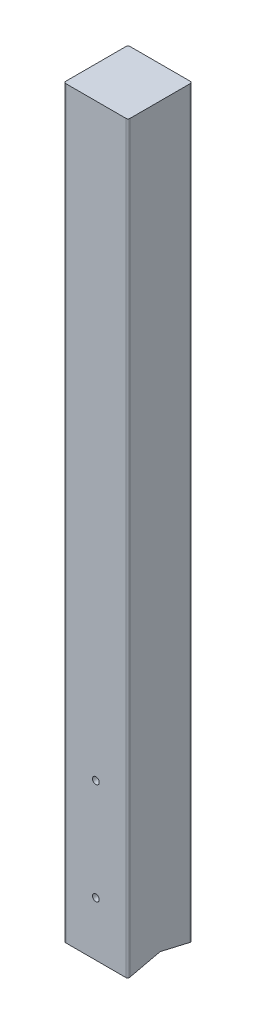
ISO-10303-21;
HEADER;
FILE_DESCRIPTION(('STEP AP214'),'2;1');
FILE_NAME('part.step','',(''),(''),'','','');
FILE_SCHEMA(('AUTOMOTIVE_DESIGN { 1 0 10303 214 1 1 1 1 }'));
ENDSEC;
DATA;
#1=APPLICATION_CONTEXT('core data for automotive mechanical design processes');
#2=APPLICATION_PROTOCOL_DEFINITION('international standard','automotive_design',2000,#1);
#3=PRODUCT_CONTEXT('',#1,'mechanical');
#4=PRODUCT('Part','Part','',(#3));
#5=PRODUCT_RELATED_PRODUCT_CATEGORY('part','',(#4));
#6=PRODUCT_DEFINITION_FORMATION('','',#4);
#7=PRODUCT_DEFINITION_CONTEXT('part definition',#1,'design');
#8=PRODUCT_DEFINITION('design','',#6,#7);
#9=PRODUCT_DEFINITION_SHAPE('','',#8);
#10=(LENGTH_UNIT() NAMED_UNIT(*) SI_UNIT(.MILLI.,.METRE.));
#11=(NAMED_UNIT(*) PLANE_ANGLE_UNIT() SI_UNIT($,.RADIAN.));
#12=(NAMED_UNIT(*) SI_UNIT($,.STERADIAN.) SOLID_ANGLE_UNIT());
#13=UNCERTAINTY_MEASURE_WITH_UNIT(LENGTH_MEASURE(1.E-05),#10,'distance_accuracy_value','');
#14=(GEOMETRIC_REPRESENTATION_CONTEXT(3) GLOBAL_UNCERTAINTY_ASSIGNED_CONTEXT((#13)) GLOBAL_UNIT_ASSIGNED_CONTEXT((#10,
#11,#12)) REPRESENTATION_CONTEXT('',''));
#15=CARTESIAN_POINT('',(0.,0.,0.));
#16=DIRECTION('',(0.,0.,1.));
#17=DIRECTION('',(1.,0.,0.));
#18=AXIS2_PLACEMENT_3D('',#15,#16,#17);
#19=CARTESIAN_POINT('',(0.,80.,47.501));
#20=DIRECTION('',(0.,0.,-1.));
#21=DIRECTION('',(-1.,0.,0.));
#22=AXIS2_PLACEMENT_3D('',#19,#20,#21);
#23=CYLINDRICAL_SURFACE('',#22,5.);
#24=CARTESIAN_POINT('',(0.,80.,47.5));
#25=DIRECTION('',(0.,0.,-1.));
#26=DIRECTION('',(-1.,0.,0.));
#27=AXIS2_PLACEMENT_3D('',#24,#25,#26);
#28=CIRCLE('',#27,5.);
#29=CARTESIAN_POINT('',(-5.,80.,47.5));
#30=VERTEX_POINT('',#29);
#31=EDGE_CURVE('E153',#30,#30,#28,.T.);
#32=ORIENTED_EDGE('',*,*,#31,.F.);
#33=EDGE_LOOP('',(#32));
#34=FACE_BOUND('',#33,.T.);
#35=CARTESIAN_POINT('',(-5.,80.,32.1130814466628));
#36=CARTESIAN_POINT('',(-5.00000195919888,80.1395798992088,32.1130806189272));
#37=CARTESIAN_POINT('',(-4.99415332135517,80.2791325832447,32.1139932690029));
#38=CARTESIAN_POINT('',(-4.9708059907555,80.5572799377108,32.1176156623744));
#39=CARTESIAN_POINT('',(-4.95330487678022,80.6958744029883,32.1203257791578));
#40=CARTESIAN_POINT('',(-4.90676610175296,80.9711589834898,32.1274679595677));
#41=CARTESIAN_POINT('',(-4.87772070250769,81.107847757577,32.131901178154));
#42=CARTESIAN_POINT('',(-4.80830138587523,81.3783091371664,32.1423625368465));
#43=CARTESIAN_POINT('',(-4.76792331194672,81.5120806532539,32.1483912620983));
#44=CARTESIAN_POINT('',(-4.67619783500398,81.7755591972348,32.1618612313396));
#45=CARTESIAN_POINT('',(-4.62486322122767,81.9052707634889,32.1693008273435));
#46=CARTESIAN_POINT('',(-4.51155169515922,82.1599380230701,32.1853875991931));
#47=CARTESIAN_POINT('',(-4.44957086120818,82.2848919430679,32.1940352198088));
#48=CARTESIAN_POINT('',(-4.31545967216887,82.5290710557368,32.2122862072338));
#49=CARTESIAN_POINT('',(-4.24333453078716,82.6482991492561,32.2218890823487));
#50=CARTESIAN_POINT('',(-4.08939050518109,82.8803257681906,32.2417882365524));
#51=CARTESIAN_POINT('',(-4.00756802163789,82.993121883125,32.2520847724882));
#52=CARTESIAN_POINT('',(-3.83419895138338,83.2122541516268,32.2731559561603));
#53=CARTESIAN_POINT('',(-3.7425869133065,83.3185382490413,32.2839335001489));
#54=CARTESIAN_POINT('',(-3.55072830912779,83.5230663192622,32.3055977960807));
#55=CARTESIAN_POINT('',(-3.45047855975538,83.6213073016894,32.3164845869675));
#56=CARTESIAN_POINT('',(-3.24209755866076,83.8089971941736,32.3380545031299));
#57=CARTESIAN_POINT('',(-3.13396876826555,83.8984488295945,32.3487376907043));
#58=CARTESIAN_POINT('',(-2.9105049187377,84.0680019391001,32.3696085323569));
#59=CARTESIAN_POINT('',(-2.79516721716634,84.148099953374,32.3797960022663));
#60=CARTESIAN_POINT('',(-2.55755727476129,84.2986947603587,32.3994316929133));
#61=CARTESIAN_POINT('',(-2.43525494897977,84.3691445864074,32.4088762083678));
#62=CARTESIAN_POINT('',(-2.18502800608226,84.4995072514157,32.4267080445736));
#63=CARTESIAN_POINT('',(-2.05710131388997,84.5594161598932,32.4350949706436));
#64=CARTESIAN_POINT('',(-1.79661354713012,84.6681990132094,32.450565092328));
#65=CARTESIAN_POINT('',(-1.66405441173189,84.717077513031,32.4576488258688));
#66=CARTESIAN_POINT('',(-1.39520121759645,84.8034768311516,32.4703186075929));
#67=CARTESIAN_POINT('',(-1.25890581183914,84.8409934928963,32.4759041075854));
#68=CARTESIAN_POINT('',(-0.848150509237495,84.93547893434,32.4900735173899));
#69=CARTESIAN_POINT('',(-0.569453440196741,84.9753683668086,32.4962151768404));
#70=CARTESIAN_POINT('',(-0.00941136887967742,85.0078633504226,32.501207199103));
#71=CARTESIAN_POINT('',(0.271933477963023,85.0004716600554,32.5000579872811));
#72=CARTESIAN_POINT('',(0.826964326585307,84.9389664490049,32.4906523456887));
#73=CARTESIAN_POINT('',(1.10069493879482,84.8852479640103,32.482456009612));
#74=CARTESIAN_POINT('',(1.63519916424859,84.7332177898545,32.4599406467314));
#75=CARTESIAN_POINT('',(1.8959724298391,84.6349049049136,32.4456214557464));
#76=CARTESIAN_POINT('',(2.39836413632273,84.3960792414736,32.4123670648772));
#77=CARTESIAN_POINT('',(2.63990263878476,84.25540090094,32.3934138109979));
#78=CARTESIAN_POINT('',(3.09609321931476,83.9359574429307,32.3530019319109));
#79=CARTESIAN_POINT('',(3.31074343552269,83.7571896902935,32.3315431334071));
#80=CARTESIAN_POINT('',(3.70939574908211,83.364443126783,32.2882499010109));
#81=CARTESIAN_POINT('',(3.89305786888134,83.1501192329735,32.2664138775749));
#82=CARTESIAN_POINT('',(4.22186329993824,82.6935144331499,32.2250433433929));
#83=CARTESIAN_POINT('',(4.36700635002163,82.4512333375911,32.2055088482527));
#84=CARTESIAN_POINT('',(4.61470418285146,81.9452284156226,32.170953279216));
#85=CARTESIAN_POINT('',(4.71722269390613,81.6814865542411,32.1559360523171));
#86=CARTESIAN_POINT('',(4.87641223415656,81.1402449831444,32.1321823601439));
#87=CARTESIAN_POINT('',(4.93308667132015,80.8627462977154,32.1234454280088));
#88=CARTESIAN_POINT('',(4.99851026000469,80.3048968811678,32.11333050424));
#89=CARTESIAN_POINT('',(5.00774195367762,80.0246040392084,32.1118784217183));
#90=CARTESIAN_POINT('',(4.97929961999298,79.4664749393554,32.1163007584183));
#91=CARTESIAN_POINT('',(4.9416271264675,79.1886386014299,32.1221749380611));
#92=CARTESIAN_POINT('',(4.82085556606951,78.6448125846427,32.1405197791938));
#93=CARTESIAN_POINT('',(4.7379980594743,78.3787679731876,32.1529553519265));
#94=CARTESIAN_POINT('',(4.52946015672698,77.8643425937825,32.1829927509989));
#95=CARTESIAN_POINT('',(4.40377754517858,77.6159627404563,32.2005948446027));
#96=CARTESIAN_POINT('',(4.11200255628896,77.1417577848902,32.2391560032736));
#97=CARTESIAN_POINT('',(3.94559851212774,76.9161265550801,32.2601405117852));
#98=CARTESIAN_POINT('',(3.57753529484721,76.4958192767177,32.3030259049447));
#99=CARTESIAN_POINT('',(3.37587402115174,76.301145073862,32.3249268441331));
#100=CARTESIAN_POINT('',(2.94089659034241,75.9465381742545,32.3674097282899));
#101=CARTESIAN_POINT('',(2.70731790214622,75.7869257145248,32.3879783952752));
#102=CARTESIAN_POINT('',(2.21637127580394,75.5092081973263,32.4252709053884));
#103=CARTESIAN_POINT('',(1.95900401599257,75.3911019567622,32.4419948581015));
#104=CARTESIAN_POINT('',(1.42882809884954,75.2002533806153,32.4696573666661));
#105=CARTESIAN_POINT('',(1.15608290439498,75.1273376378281,32.4806180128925));
#106=CARTESIAN_POINT('',(0.601882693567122,75.0283971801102,32.495604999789));
#107=CARTESIAN_POINT('',(0.320428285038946,75.0023692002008,32.4996318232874));
#108=CARTESIAN_POINT('',(-0.100292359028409,74.9990547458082,32.5001472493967));
#109=CARTESIAN_POINT('',(-0.239639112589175,75.00380004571,32.4994144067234));
#110=CARTESIAN_POINT('',(-0.517416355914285,75.0248977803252,32.4961767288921));
#111=CARTESIAN_POINT('',(-0.655847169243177,75.0412458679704,32.4936725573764));
#112=CARTESIAN_POINT('',(-0.930859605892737,75.0854384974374,32.4869581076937));
#113=CARTESIAN_POINT('',(-1.06744054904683,75.1132871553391,32.4827472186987));
#114=CARTESIAN_POINT('',(-1.33770050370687,75.1802564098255,32.4727398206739));
#115=CARTESIAN_POINT('',(-1.47138054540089,75.2193729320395,32.4669438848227));
#116=CARTESIAN_POINT('',(-1.73488904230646,75.3085715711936,32.4539297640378));
#117=CARTESIAN_POINT('',(-1.86471924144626,75.3586486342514,32.4467122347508));
#118=CARTESIAN_POINT('',(-2.11964837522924,75.4693933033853,32.4310560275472));
#119=CARTESIAN_POINT('',(-2.24474899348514,75.5300570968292,32.4226177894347));
#120=CARTESIAN_POINT('',(-2.48945855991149,75.6615787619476,32.4047474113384));
#121=CARTESIAN_POINT('',(-2.60906538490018,75.732440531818,32.3953148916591));
#122=CARTESIAN_POINT('',(-2.84188245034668,75.8838152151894,32.3757215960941));
#123=CARTESIAN_POINT('',(-2.95509493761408,75.9643247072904,32.3655610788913));
#124=CARTESIAN_POINT('',(-3.17552475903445,76.1353269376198,32.3446815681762));
#125=CARTESIAN_POINT('',(-3.28266918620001,76.2259131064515,32.3339579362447));
#126=CARTESIAN_POINT('',(-3.48892367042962,76.41572225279,32.3123530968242));
#127=CARTESIAN_POINT('',(-3.58803659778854,76.5149421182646,32.3014719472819));
#128=CARTESIAN_POINT('',(-3.77764519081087,76.7214248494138,32.2798468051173));
#129=CARTESIAN_POINT('',(-3.86813564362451,76.8286925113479,32.2691028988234));
#130=CARTESIAN_POINT('',(-4.03976997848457,77.0504391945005,32.2480655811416));
#131=CARTESIAN_POINT('',(-4.12091729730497,77.1649155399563,32.2377720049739));
#132=CARTESIAN_POINT('',(-4.27381455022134,77.4010732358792,32.217859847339));
#133=CARTESIAN_POINT('',(-4.34550181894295,77.5227955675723,32.208245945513));
#134=CARTESIAN_POINT('',(-4.47832604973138,77.771881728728,32.1900464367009));
#135=CARTESIAN_POINT('',(-4.53946689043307,77.8992434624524,32.181460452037));
#136=CARTESIAN_POINT('',(-4.65073880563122,78.1586607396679,32.165568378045));
#137=CARTESIAN_POINT('',(-4.7008778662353,78.290712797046,32.1582613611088));
#138=CARTESIAN_POINT('',(-4.78981342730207,78.5586081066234,32.1451349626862));
#139=CARTESIAN_POINT('',(-4.8286124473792,78.6944505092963,32.1393152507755));
#140=CARTESIAN_POINT('',(-4.90749218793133,79.0227224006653,32.1273826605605));
#141=CARTESIAN_POINT('',(-4.94214325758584,79.2165111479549,32.1220447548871));
#142=CARTESIAN_POINT('',(-4.98839562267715,79.6068846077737,32.1148947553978));
#143=CARTESIAN_POINT('',(-4.99999724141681,79.8034692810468,32.1130826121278));
#144=CARTESIAN_POINT('',(-5.,80.,32.1130814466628));
#145=B_SPLINE_CURVE_WITH_KNOTS('',3,(#35,#36,#37,#38,#39,#40,#41,#42,#43,#44,#45,#46,#47,#48,
#49,#50,#51,#52,#53,#54,#55,#56,#57,#58,#59,#60,#61,#62,#63,#64,#65,#66,#67,#68,#69,#70,#71,#72,
#73,#74,#75,#76,#77,#78,#79,#80,#81,#82,#83,#84,#85,#86,#87,#88,#89,#90,#91,#92,#93,#94,#95,#96,
#97,#98,#99,#100,#101,#102,#103,#104,#105,#106,#107,#108,#109,#110,#111,#112,#113,#114,#115,
#116,#117,#118,#119,#120,#121,#122,#123,#124,#125,#126,#127,#128,#129,#130,#131,#132,#133,#134,
#135,#136,#137,#138,#139,#140,#141,#142,#143,#144),.UNSPECIFIED.,.T.,.F.,(4,2,2,2,2,2,2,2,2,2,2,
2,2,2,2,2,2,2,2,2,2,2,2,2,2,2,2,2,2,2,2,2,2,2,2,2,2,2,2,2,2,2,2,2,2,2,2,2,2,2,2,2,2,2,4),(0.,
0.418567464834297,0.837221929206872,1.25615749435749,1.6752469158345,2.09384979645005,
2.51260720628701,2.93115017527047,3.34984898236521,3.77154672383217,4.19340054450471,
4.61512314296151,5.03700124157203,5.46086508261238,5.8848866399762,6.30873277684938,
6.73273378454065,7.57312809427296,8.41347337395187,9.24672296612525,10.0799949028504,
10.9165664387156,11.7531958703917,12.5984790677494,13.4437679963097,14.2897747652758,
15.1357186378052,15.973041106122,16.8103361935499,17.6431983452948,18.4761035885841,
19.3155947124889,20.1551358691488,21.0020525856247,21.8489451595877,22.6925675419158,
23.5361311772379,23.9540124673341,24.371737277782,24.789611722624,25.2073352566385,
25.6248665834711,26.0422478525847,26.459789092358,26.8771826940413,27.2988325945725,
27.7203311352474,28.14208290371,28.5636790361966,28.9879409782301,29.4120465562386,
29.8358432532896,30.2595457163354,30.8489036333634,31.4382532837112),.UNSPECIFIED.);
#146=CARTESIAN_POINT('',(-5.,80.,32.1130814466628));
#147=VERTEX_POINT('',#146);
#148=EDGE_CURVE('E131',#147,#147,#145,.T.);
#149=ORIENTED_EDGE('',*,*,#148,.T.);
#150=EDGE_LOOP('',(#149));
#151=FACE_BOUND('',#150,.T.);
#152=ADVANCED_FACE('F27',(#34,#151),#23,.F.);
#153=CARTESIAN_POINT('',(0.,80.,-47.5));
#154=DIRECTION('',(0.,0.,1.));
#155=DIRECTION('',(1.,0.,0.));
#156=AXIS2_PLACEMENT_3D('',#153,#154,#155);
#157=CIRCLE('',#156,5.);
#158=CARTESIAN_POINT('',(5.,80.,-47.5));
#159=VERTEX_POINT('',#158);
#160=EDGE_CURVE('E150',#159,#159,#157,.F.);
#161=ORIENTED_EDGE('',*,*,#160,.T.);
#162=EDGE_LOOP('',(#161));
#163=FACE_BOUND('',#162,.T.);
#164=CARTESIAN_POINT('',(-5.,80.,-32.1130814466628));
#165=CARTESIAN_POINT('',(-5.00000195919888,79.8604201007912,-32.1130806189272));
#166=CARTESIAN_POINT('',(-4.99415332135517,79.7208674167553,-32.1139932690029));
#167=CARTESIAN_POINT('',(-4.9708059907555,79.4427200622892,-32.1176156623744));
#168=CARTESIAN_POINT('',(-4.95330487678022,79.3041255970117,-32.1203257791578));
#169=CARTESIAN_POINT('',(-4.90676610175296,79.0288410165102,-32.1274679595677));
#170=CARTESIAN_POINT('',(-4.87772070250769,78.892152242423,-32.131901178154));
#171=CARTESIAN_POINT('',(-4.80830138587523,78.6216908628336,-32.1423625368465));
#172=CARTESIAN_POINT('',(-4.76792331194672,78.4879193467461,-32.1483912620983));
#173=CARTESIAN_POINT('',(-4.67619783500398,78.2244408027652,-32.1618612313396));
#174=CARTESIAN_POINT('',(-4.62486322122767,78.0947292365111,-32.1693008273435));
#175=CARTESIAN_POINT('',(-4.51155169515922,77.8400619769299,-32.1853875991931));
#176=CARTESIAN_POINT('',(-4.44957086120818,77.7151080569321,-32.1940352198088));
#177=CARTESIAN_POINT('',(-4.31545967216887,77.4709289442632,-32.2122862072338));
#178=CARTESIAN_POINT('',(-4.24333453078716,77.3517008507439,-32.2218890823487));
#179=CARTESIAN_POINT('',(-4.08939050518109,77.1196742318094,-32.2417882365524));
#180=CARTESIAN_POINT('',(-4.00756802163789,77.006878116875,-32.2520847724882));
#181=CARTESIAN_POINT('',(-3.83419895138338,76.7877458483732,-32.2731559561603));
#182=CARTESIAN_POINT('',(-3.7425869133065,76.6814617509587,-32.2839335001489));
#183=CARTESIAN_POINT('',(-3.55072830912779,76.4769336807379,-32.3055977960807));
#184=CARTESIAN_POINT('',(-3.45047855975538,76.3786926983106,-32.3164845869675));
#185=CARTESIAN_POINT('',(-3.24209755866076,76.1910028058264,-32.3380545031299));
#186=CARTESIAN_POINT('',(-3.13396876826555,76.1015511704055,-32.3487376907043));
#187=CARTESIAN_POINT('',(-2.9105049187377,75.9319980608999,-32.3696085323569));
#188=CARTESIAN_POINT('',(-2.79516721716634,75.851900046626,-32.3797960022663));
#189=CARTESIAN_POINT('',(-2.55755727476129,75.7013052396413,-32.3994316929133));
#190=CARTESIAN_POINT('',(-2.43525494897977,75.6308554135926,-32.4088762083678));
#191=CARTESIAN_POINT('',(-2.18502800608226,75.5004927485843,-32.4267080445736));
#192=CARTESIAN_POINT('',(-2.05710131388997,75.4405838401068,-32.4350949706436));
#193=CARTESIAN_POINT('',(-1.79661354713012,75.3318009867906,-32.450565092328));
#194=CARTESIAN_POINT('',(-1.6640544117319,75.282922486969,-32.4576488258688));
#195=CARTESIAN_POINT('',(-1.39520121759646,75.1965231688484,-32.4703186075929));
#196=CARTESIAN_POINT('',(-1.25890581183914,75.1590065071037,-32.4759041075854));
#197=CARTESIAN_POINT('',(-0.848150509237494,75.06452106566,-32.4900735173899));
#198=CARTESIAN_POINT('',(-0.569453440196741,75.0246316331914,-32.4962151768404));
#199=CARTESIAN_POINT('',(-0.00941136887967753,74.9921366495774,-32.501207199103));
#200=CARTESIAN_POINT('',(0.271933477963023,74.9995283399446,-32.5000579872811));
#201=CARTESIAN_POINT('',(0.826964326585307,75.0610335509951,-32.4906523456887));
#202=CARTESIAN_POINT('',(1.10069493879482,75.1147520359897,-32.482456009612));
#203=CARTESIAN_POINT('',(1.63519916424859,75.2667822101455,-32.4599406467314));
#204=CARTESIAN_POINT('',(1.8959724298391,75.3650950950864,-32.4456214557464));
#205=CARTESIAN_POINT('',(2.39836413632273,75.6039207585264,-32.4123670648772));
#206=CARTESIAN_POINT('',(2.63990263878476,75.7445990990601,-32.3934138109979));
#207=CARTESIAN_POINT('',(3.09609321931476,76.0640425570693,-32.3530019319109));
#208=CARTESIAN_POINT('',(3.31074343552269,76.2428103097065,-32.3315431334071));
#209=CARTESIAN_POINT('',(3.70939574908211,76.635556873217,-32.2882499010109));
#210=CARTESIAN_POINT('',(3.89305786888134,76.8498807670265,-32.2664138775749));
#211=CARTESIAN_POINT('',(4.22186329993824,77.3064855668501,-32.2250433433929));
#212=CARTESIAN_POINT('',(4.36700635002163,77.5487666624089,-32.2055088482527));
#213=CARTESIAN_POINT('',(4.61470418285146,78.0547715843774,-32.170953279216));
#214=CARTESIAN_POINT('',(4.71722269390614,78.3185134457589,-32.1559360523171));
#215=CARTESIAN_POINT('',(4.87641223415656,78.8597550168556,-32.1321823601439));
#216=CARTESIAN_POINT('',(4.93308667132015,79.1372537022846,-32.1234454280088));
#217=CARTESIAN_POINT('',(4.99851026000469,79.6951031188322,-32.11333050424));
#218=CARTESIAN_POINT('',(5.00774195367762,79.9753959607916,-32.1118784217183));
#219=CARTESIAN_POINT('',(4.97929961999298,80.5335250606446,-32.1163007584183));
#220=CARTESIAN_POINT('',(4.9416271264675,80.8113613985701,-32.1221749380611));
#221=CARTESIAN_POINT('',(4.82085556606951,81.3551874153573,-32.1405197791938));
#222=CARTESIAN_POINT('',(4.7379980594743,81.6212320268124,-32.1529553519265));
#223=CARTESIAN_POINT('',(4.52946015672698,82.1356574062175,-32.1829927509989));
#224=CARTESIAN_POINT('',(4.40377754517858,82.3840372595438,-32.2005948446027));
#225=CARTESIAN_POINT('',(4.11200255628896,82.8582422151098,-32.2391560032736));
#226=CARTESIAN_POINT('',(3.94559851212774,83.0838734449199,-32.2601405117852));
#227=CARTESIAN_POINT('',(3.57753529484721,83.5041807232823,-32.3030259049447));
#228=CARTESIAN_POINT('',(3.37587402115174,83.698854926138,-32.3249268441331));
#229=CARTESIAN_POINT('',(2.94089659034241,84.0534618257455,-32.3674097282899));
#230=CARTESIAN_POINT('',(2.70731790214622,84.2130742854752,-32.3879783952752));
#231=CARTESIAN_POINT('',(2.21637127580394,84.4907918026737,-32.4252709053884));
#232=CARTESIAN_POINT('',(1.95900401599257,84.6088980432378,-32.4419948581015));
#233=CARTESIAN_POINT('',(1.42882809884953,84.7997466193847,-32.4696573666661));
#234=CARTESIAN_POINT('',(1.15608290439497,84.8726623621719,-32.4806180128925));
#235=CARTESIAN_POINT('',(0.601882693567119,84.9716028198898,-32.495604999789));
#236=CARTESIAN_POINT('',(0.320428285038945,84.9976307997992,-32.4996318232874));
#237=CARTESIAN_POINT('',(-0.100292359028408,85.0009452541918,-32.5001472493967));
#238=CARTESIAN_POINT('',(-0.239639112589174,84.99619995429,-32.4994144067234));
#239=CARTESIAN_POINT('',(-0.517416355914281,84.9751022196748,-32.4961767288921));
#240=CARTESIAN_POINT('',(-0.655847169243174,84.9587541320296,-32.4936725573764));
#241=CARTESIAN_POINT('',(-0.930859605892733,84.9145615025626,-32.4869581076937));
#242=CARTESIAN_POINT('',(-1.06744054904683,84.8867128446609,-32.4827472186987));
#243=CARTESIAN_POINT('',(-1.33770050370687,84.8197435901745,-32.4727398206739));
#244=CARTESIAN_POINT('',(-1.47138054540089,84.7806270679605,-32.4669438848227));
#245=CARTESIAN_POINT('',(-1.73488904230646,84.6914284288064,-32.4539297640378));
#246=CARTESIAN_POINT('',(-1.86471924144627,84.6413513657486,-32.4467122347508));
#247=CARTESIAN_POINT('',(-2.11964837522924,84.5306066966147,-32.4310560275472));
#248=CARTESIAN_POINT('',(-2.24474899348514,84.4699429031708,-32.4226177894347));
#249=CARTESIAN_POINT('',(-2.48945855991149,84.3384212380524,-32.4047474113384));
#250=CARTESIAN_POINT('',(-2.60906538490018,84.267559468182,-32.3953148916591));
#251=CARTESIAN_POINT('',(-2.84188245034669,84.1161847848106,-32.3757215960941));
#252=CARTESIAN_POINT('',(-2.95509493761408,84.0356752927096,-32.3655610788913));
#253=CARTESIAN_POINT('',(-3.17552475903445,83.8646730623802,-32.3446815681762));
#254=CARTESIAN_POINT('',(-3.28266918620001,83.7740868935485,-32.3339579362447));
#255=CARTESIAN_POINT('',(-3.48892367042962,83.58427774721,-32.3123530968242));
#256=CARTESIAN_POINT('',(-3.58803659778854,83.4850578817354,-32.3014719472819));
#257=CARTESIAN_POINT('',(-3.77764519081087,83.2785751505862,-32.2798468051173));
#258=CARTESIAN_POINT('',(-3.86813564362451,83.1713074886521,-32.2691028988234));
#259=CARTESIAN_POINT('',(-4.03976997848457,82.9495608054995,-32.2480655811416));
#260=CARTESIAN_POINT('',(-4.12091729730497,82.8350844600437,-32.2377720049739));
#261=CARTESIAN_POINT('',(-4.27381455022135,82.5989267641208,-32.217859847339));
#262=CARTESIAN_POINT('',(-4.34550181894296,82.4772044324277,-32.208245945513));
#263=CARTESIAN_POINT('',(-4.47832604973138,82.228118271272,-32.1900464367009));
#264=CARTESIAN_POINT('',(-4.53946689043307,82.1007565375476,-32.181460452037));
#265=CARTESIAN_POINT('',(-4.65073880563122,81.8413392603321,-32.165568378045));
#266=CARTESIAN_POINT('',(-4.7008778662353,81.709287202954,-32.1582613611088));
#267=CARTESIAN_POINT('',(-4.78981342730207,81.4413918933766,-32.1451349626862));
#268=CARTESIAN_POINT('',(-4.8286124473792,81.3055494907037,-32.1393152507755));
#269=CARTESIAN_POINT('',(-4.90749218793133,80.9772775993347,-32.1273826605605));
#270=CARTESIAN_POINT('',(-4.94214325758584,80.7834888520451,-32.1220447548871));
#271=CARTESIAN_POINT('',(-4.98839562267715,80.3931153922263,-32.1148947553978));
#272=CARTESIAN_POINT('',(-4.99999724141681,80.1965307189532,-32.1130826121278));
#273=CARTESIAN_POINT('',(-5.,80.,-32.1130814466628));
#274=B_SPLINE_CURVE_WITH_KNOTS('',3,(#164,#165,#166,#167,#168,#169,#170,#171,#172,#173,#174,
#175,#176,#177,#178,#179,#180,#181,#182,#183,#184,#185,#186,#187,#188,#189,#190,#191,#192,#193,
#194,#195,#196,#197,#198,#199,#200,#201,#202,#203,#204,#205,#206,#207,#208,#209,#210,#211,#212,
#213,#214,#215,#216,#217,#218,#219,#220,#221,#222,#223,#224,#225,#226,#227,#228,#229,#230,#231,
#232,#233,#234,#235,#236,#237,#238,#239,#240,#241,#242,#243,#244,#245,#246,#247,#248,#249,#250,
#251,#252,#253,#254,#255,#256,#257,#258,#259,#260,#261,#262,#263,#264,#265,#266,#267,#268,#269,
#270,#271,#272,#273),.UNSPECIFIED.,.T.,.F.,(4,2,2,2,2,2,2,2,2,2,2,2,2,2,2,2,2,2,2,2,2,2,2,2,2,2,
2,2,2,2,2,2,2,2,2,2,2,2,2,2,2,2,2,2,2,2,2,2,2,2,2,2,2,2,4),(0.,0.418567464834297,
0.837221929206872,1.25615749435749,1.6752469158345,2.09384979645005,2.51260720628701,
2.93115017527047,3.34984898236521,3.77154672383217,4.19340054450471,4.61512314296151,
5.03700124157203,5.46086508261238,5.8848866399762,6.30873277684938,6.73273378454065,
7.57312809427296,8.41347337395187,9.24672296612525,10.0799949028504,10.9165664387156,
11.7531958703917,12.5984790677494,13.4437679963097,14.2897747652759,15.1357186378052,
15.973041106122,16.8103361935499,17.6431983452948,18.4761035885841,19.3155947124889,
20.1551358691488,21.0020525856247,21.8489451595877,22.6925675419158,23.5361311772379,
23.9540124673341,24.371737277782,24.789611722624,25.2073352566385,25.6248665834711,
26.0422478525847,26.459789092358,26.8771826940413,27.2988325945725,27.7203311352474,
28.14208290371,28.5636790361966,28.9879409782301,29.4120465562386,29.8358432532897,
30.2595457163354,30.8489036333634,31.4382532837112),.UNSPECIFIED.);
#275=CARTESIAN_POINT('',(-5.,80.,-32.1130814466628));
#276=VERTEX_POINT('',#275);
#277=EDGE_CURVE('E259',#276,#276,#274,.T.);
#278=ORIENTED_EDGE('',*,*,#277,.T.);
#279=EDGE_LOOP('',(#278));
#280=FACE_BOUND('',#279,.T.);
#281=ADVANCED_FACE('F243',(#163,#280),#23,.F.);
#282=CARTESIAN_POINT('',(0.,230.,47.501));
#283=DIRECTION('',(0.,0.,-1.));
#284=DIRECTION('',(-1.,0.,0.));
#285=AXIS2_PLACEMENT_3D('',#282,#283,#284);
#286=CYLINDRICAL_SURFACE('',#285,5.00000000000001);
#287=CARTESIAN_POINT('',(0.,230.,47.5));
#288=DIRECTION('',(0.,0.,-1.));
#289=DIRECTION('',(-1.,0.,0.));
#290=AXIS2_PLACEMENT_3D('',#287,#288,#289);
#291=CIRCLE('',#290,5.00000000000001);
#292=CARTESIAN_POINT('',(-5.00000000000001,230.,47.5));
#293=VERTEX_POINT('',#292);
#294=EDGE_CURVE('E147',#293,#293,#291,.T.);
#295=ORIENTED_EDGE('',*,*,#294,.F.);
#296=EDGE_LOOP('',(#295));
#297=FACE_BOUND('',#296,.T.);
#298=CARTESIAN_POINT('',(-5.00000000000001,230.,32.1130814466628));
#299=CARTESIAN_POINT('',(-5.00000195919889,230.139579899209,32.1130806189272));
#300=CARTESIAN_POINT('',(-4.99415332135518,230.279132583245,32.1139932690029));
#301=CARTESIAN_POINT('',(-4.97080599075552,230.557279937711,32.1176156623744));
#302=CARTESIAN_POINT('',(-4.95330487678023,230.695874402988,32.1203257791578));
#303=CARTESIAN_POINT('',(-4.90676610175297,230.97115898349,32.1274679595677));
#304=CARTESIAN_POINT('',(-4.8777207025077,231.107847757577,32.131901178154));
#305=CARTESIAN_POINT('',(-4.80830138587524,231.378309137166,32.1423625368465));
#306=CARTESIAN_POINT('',(-4.76792331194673,231.512080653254,32.1483912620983));
#307=CARTESIAN_POINT('',(-4.676197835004,231.775559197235,32.1618612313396));
#308=CARTESIAN_POINT('',(-4.62486322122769,231.905270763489,32.1693008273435));
#309=CARTESIAN_POINT('',(-4.51155169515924,232.15993802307,32.1853875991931));
#310=CARTESIAN_POINT('',(-4.4495708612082,232.284891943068,32.1940352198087));
#311=CARTESIAN_POINT('',(-4.31545967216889,232.529071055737,32.2122862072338));
#312=CARTESIAN_POINT('',(-4.24333453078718,232.648299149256,32.2218890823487));
#313=CARTESIAN_POINT('',(-4.08939050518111,232.880325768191,32.2417882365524));
#314=CARTESIAN_POINT('',(-4.00756802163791,232.993121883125,32.2520847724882));
#315=CARTESIAN_POINT('',(-3.8341989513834,233.212254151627,32.2731559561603));
#316=CARTESIAN_POINT('',(-3.74258691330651,233.318538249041,32.2839335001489));
#317=CARTESIAN_POINT('',(-3.5507283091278,233.523066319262,32.3055977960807));
#318=CARTESIAN_POINT('',(-3.4504785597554,233.621307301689,32.3164845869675));
#319=CARTESIAN_POINT('',(-3.24209755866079,233.808997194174,32.3380545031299));
#320=CARTESIAN_POINT('',(-3.13396876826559,233.898448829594,32.3487376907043));
#321=CARTESIAN_POINT('',(-2.91050491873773,234.0680019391,32.3696085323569));
#322=CARTESIAN_POINT('',(-2.79516721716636,234.148099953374,32.3797960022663));
#323=CARTESIAN_POINT('',(-2.55755727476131,234.298694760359,32.3994316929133));
#324=CARTESIAN_POINT('',(-2.4352549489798,234.369144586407,32.4088762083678));
#325=CARTESIAN_POINT('',(-2.18502800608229,234.499507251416,32.4267080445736));
#326=CARTESIAN_POINT('',(-2.05710131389,234.559416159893,32.4350949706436));
#327=CARTESIAN_POINT('',(-1.79661354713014,234.668199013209,32.450565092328));
#328=CARTESIAN_POINT('',(-1.66405441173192,234.717077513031,32.4576488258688));
#329=CARTESIAN_POINT('',(-1.39520121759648,234.803476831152,32.4703186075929));
#330=CARTESIAN_POINT('',(-1.25890581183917,234.840993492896,32.4759041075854));
#331=CARTESIAN_POINT('',(-0.848150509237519,234.93547893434,32.4900735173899));
#332=CARTESIAN_POINT('',(-0.569453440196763,234.975368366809,32.4962151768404));
#333=CARTESIAN_POINT('',(-0.0094113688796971,235.007863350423,32.501207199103));
#334=CARTESIAN_POINT('',(0.271933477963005,235.000471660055,32.5000579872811));
#335=CARTESIAN_POINT('',(0.826964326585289,234.938966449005,32.4906523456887));
#336=CARTESIAN_POINT('',(1.1006949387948,234.88524796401,32.482456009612));
#337=CARTESIAN_POINT('',(1.63519916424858,234.733217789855,32.4599406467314));
#338=CARTESIAN_POINT('',(1.89597242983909,234.634904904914,32.4456214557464));
#339=CARTESIAN_POINT('',(2.39836413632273,234.396079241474,32.4123670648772));
#340=CARTESIAN_POINT('',(2.63990263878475,234.25540090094,32.3934138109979));
#341=CARTESIAN_POINT('',(3.09609321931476,233.935957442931,32.3530019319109));
#342=CARTESIAN_POINT('',(3.31074343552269,233.757189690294,32.3315431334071));
#343=CARTESIAN_POINT('',(3.70939574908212,233.364443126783,32.2882499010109));
#344=CARTESIAN_POINT('',(3.89305786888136,233.150119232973,32.2664138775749));
#345=CARTESIAN_POINT('',(4.22186329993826,232.69351443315,32.2250433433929));
#346=CARTESIAN_POINT('',(4.36700635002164,232.451233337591,32.2055088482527));
#347=CARTESIAN_POINT('',(4.61470418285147,231.945228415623,32.170953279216));
#348=CARTESIAN_POINT('',(4.71722269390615,231.681486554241,32.1559360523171));
#349=CARTESIAN_POINT('',(4.87641223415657,231.140244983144,32.1321823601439));
#350=CARTESIAN_POINT('',(4.93308667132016,230.862746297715,32.1234454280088));
#351=CARTESIAN_POINT('',(4.9985102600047,230.304896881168,32.11333050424));
#352=CARTESIAN_POINT('',(5.00774195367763,230.024604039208,32.1118784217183));
#353=CARTESIAN_POINT('',(4.97929961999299,229.466474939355,32.1163007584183));
#354=CARTESIAN_POINT('',(4.94162712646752,229.18863860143,32.1221749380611));
#355=CARTESIAN_POINT('',(4.82085556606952,228.644812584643,32.1405197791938));
#356=CARTESIAN_POINT('',(4.73799805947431,228.378767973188,32.1529553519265));
#357=CARTESIAN_POINT('',(4.52946015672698,227.864342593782,32.1829927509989));
#358=CARTESIAN_POINT('',(4.40377754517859,227.615962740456,32.2005948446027));
#359=CARTESIAN_POINT('',(4.11200255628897,227.14175778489,32.2391560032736));
#360=CARTESIAN_POINT('',(3.94559851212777,226.91612655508,32.2601405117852));
#361=CARTESIAN_POINT('',(3.57753529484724,226.495819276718,32.3030259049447));
#362=CARTESIAN_POINT('',(3.37587402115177,226.301145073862,32.3249268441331));
#363=CARTESIAN_POINT('',(2.94089659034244,225.946538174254,32.3674097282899));
#364=CARTESIAN_POINT('',(2.70731790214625,225.786925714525,32.3879783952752));
#365=CARTESIAN_POINT('',(2.21637127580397,225.509208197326,32.4252709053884));
#366=CARTESIAN_POINT('',(1.95900401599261,225.391101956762,32.4419948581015));
#367=CARTESIAN_POINT('',(1.42882809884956,225.200253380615,32.4696573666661));
#368=CARTESIAN_POINT('',(1.15608290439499,225.127337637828,32.4806180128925));
#369=CARTESIAN_POINT('',(0.601882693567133,225.02839718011,32.495604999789));
#370=CARTESIAN_POINT('',(0.320428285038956,225.002369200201,32.4996318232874));
#371=CARTESIAN_POINT('',(-0.1002923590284,224.999054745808,32.5001472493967));
#372=CARTESIAN_POINT('',(-0.239639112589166,225.00380004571,32.4994144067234));
#373=CARTESIAN_POINT('',(-0.517416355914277,225.024897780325,32.4961767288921));
#374=CARTESIAN_POINT('',(-0.655847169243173,225.04124586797,32.4936725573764));
#375=CARTESIAN_POINT('',(-0.930859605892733,225.085438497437,32.4869581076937));
#376=CARTESIAN_POINT('',(-1.06744054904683,225.113287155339,32.4827472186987));
#377=CARTESIAN_POINT('',(-1.33770050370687,225.180256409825,32.4727398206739));
#378=CARTESIAN_POINT('',(-1.47138054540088,225.21937293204,32.4669438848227));
#379=CARTESIAN_POINT('',(-1.73488904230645,225.308571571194,32.4539297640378));
#380=CARTESIAN_POINT('',(-1.86471924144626,225.358648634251,32.4467122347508));
#381=CARTESIAN_POINT('',(-2.11964837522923,225.469393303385,32.4310560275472));
#382=CARTESIAN_POINT('',(-2.24474899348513,225.530057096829,32.4226177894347));
#383=CARTESIAN_POINT('',(-2.48945855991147,225.661578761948,32.4047474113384));
#384=CARTESIAN_POINT('',(-2.60906538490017,225.732440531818,32.3953148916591));
#385=CARTESIAN_POINT('',(-2.84188245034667,225.883815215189,32.3757215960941));
#386=CARTESIAN_POINT('',(-2.95509493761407,225.96432470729,32.3655610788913));
#387=CARTESIAN_POINT('',(-3.17552475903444,226.13532693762,32.3446815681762));
#388=CARTESIAN_POINT('',(-3.2826691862,226.225913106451,32.3339579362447));
#389=CARTESIAN_POINT('',(-3.4889236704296,226.41572225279,32.3123530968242));
#390=CARTESIAN_POINT('',(-3.58803659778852,226.514942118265,32.3014719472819));
#391=CARTESIAN_POINT('',(-3.77764519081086,226.721424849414,32.2798468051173));
#392=CARTESIAN_POINT('',(-3.8681356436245,226.828692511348,32.2691028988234));
#393=CARTESIAN_POINT('',(-4.03976997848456,227.0504391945,32.2480655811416));
#394=CARTESIAN_POINT('',(-4.12091729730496,227.164915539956,32.2377720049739));
#395=CARTESIAN_POINT('',(-4.27381455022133,227.401073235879,32.217859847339));
#396=CARTESIAN_POINT('',(-4.34550181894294,227.522795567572,32.208245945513));
#397=CARTESIAN_POINT('',(-4.47832604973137,227.771881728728,32.1900464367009));
#398=CARTESIAN_POINT('',(-4.53946689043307,227.899243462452,32.181460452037));
#399=CARTESIAN_POINT('',(-4.65073880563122,228.158660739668,32.165568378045));
#400=CARTESIAN_POINT('',(-4.7008778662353,228.290712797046,32.1582613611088));
#401=CARTESIAN_POINT('',(-4.78981342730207,228.558608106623,32.1451349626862));
#402=CARTESIAN_POINT('',(-4.8286124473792,228.694450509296,32.1393152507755));
#403=CARTESIAN_POINT('',(-4.90749218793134,229.022722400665,32.1273826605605));
#404=CARTESIAN_POINT('',(-4.94214325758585,229.216511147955,32.1220447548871));
#405=CARTESIAN_POINT('',(-4.98839562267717,229.606884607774,32.1148947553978));
#406=CARTESIAN_POINT('',(-4.99999724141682,229.803469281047,32.1130826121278));
#407=CARTESIAN_POINT('',(-5.00000000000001,230.,32.1130814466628));
#408=B_SPLINE_CURVE_WITH_KNOTS('',3,(#298,#299,#300,#301,#302,#303,#304,#305,#306,#307,#308,
#309,#310,#311,#312,#313,#314,#315,#316,#317,#318,#319,#320,#321,#322,#323,#324,#325,#326,#327,
#328,#329,#330,#331,#332,#333,#334,#335,#336,#337,#338,#339,#340,#341,#342,#343,#344,#345,#346,
#347,#348,#349,#350,#351,#352,#353,#354,#355,#356,#357,#358,#359,#360,#361,#362,#363,#364,#365,
#366,#367,#368,#369,#370,#371,#372,#373,#374,#375,#376,#377,#378,#379,#380,#381,#382,#383,#384,
#385,#386,#387,#388,#389,#390,#391,#392,#393,#394,#395,#396,#397,#398,#399,#400,#401,#402,#403,
#404,#405,#406,#407),.UNSPECIFIED.,.T.,.F.,(4,2,2,2,2,2,2,2,2,2,2,2,2,2,2,2,2,2,2,2,2,2,2,2,2,2,
2,2,2,2,2,2,2,2,2,2,2,2,2,2,2,2,2,2,2,2,2,2,2,2,2,2,2,2,4),(0.,0.418567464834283,
0.837221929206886,1.2561574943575,1.67524691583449,2.09384979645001,2.512607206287,
2.93115017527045,3.34984898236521,3.77154672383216,4.19340054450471,4.61512314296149,
5.03700124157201,5.46086508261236,5.88488663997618,6.30873277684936,6.73273378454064,
7.57312809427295,8.41347337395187,9.24672296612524,10.0799949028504,10.9165664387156,
11.7531958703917,12.5984790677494,13.4437679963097,14.2897747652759,15.1357186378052,
15.973041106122,16.8103361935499,17.6431983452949,18.4761035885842,19.3155947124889,
20.1551358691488,21.0020525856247,21.8489451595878,22.6925675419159,23.5361311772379,
23.9540124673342,24.371737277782,24.789611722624,25.2073352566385,25.6248665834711,
26.0422478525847,26.4597890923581,26.8771826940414,27.2988325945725,27.7203311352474,
28.14208290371,28.5636790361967,28.9879409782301,29.4120465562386,29.8358432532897,
30.2595457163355,30.8489036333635,31.4382532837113),.UNSPECIFIED.);
#409=CARTESIAN_POINT('',(-5.00000000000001,230.,32.1130814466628));
#410=VERTEX_POINT('',#409);
#411=EDGE_CURVE('E264',#410,#410,#408,.T.);
#412=ORIENTED_EDGE('',*,*,#411,.T.);
#413=EDGE_LOOP('',(#412));
#414=FACE_BOUND('',#413,.T.);
#415=ADVANCED_FACE('F248',(#297,#414),#286,.F.);
#416=CARTESIAN_POINT('',(0.,230.,-47.5));
#417=DIRECTION('',(0.,0.,1.));
#418=DIRECTION('',(1.,0.,0.));
#419=AXIS2_PLACEMENT_3D('',#416,#417,#418);
#420=CIRCLE('',#419,5.00000000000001);
#421=CARTESIAN_POINT('',(5.00000000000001,230.,-47.5));
#422=VERTEX_POINT('',#421);
#423=EDGE_CURVE('E144',#422,#422,#420,.F.);
#424=ORIENTED_EDGE('',*,*,#423,.T.);
#425=EDGE_LOOP('',(#424));
#426=FACE_BOUND('',#425,.T.);
#427=CARTESIAN_POINT('',(-5.00000000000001,230.,-32.1130814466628));
#428=CARTESIAN_POINT('',(-5.00000195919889,229.860420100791,-32.1130806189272));
#429=CARTESIAN_POINT('',(-4.99415332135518,229.720867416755,-32.1139932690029));
#430=CARTESIAN_POINT('',(-4.97080599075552,229.442720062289,-32.1176156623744));
#431=CARTESIAN_POINT('',(-4.95330487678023,229.304125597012,-32.1203257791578));
#432=CARTESIAN_POINT('',(-4.90676610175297,229.02884101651,-32.1274679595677));
#433=CARTESIAN_POINT('',(-4.8777207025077,228.892152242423,-32.131901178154));
#434=CARTESIAN_POINT('',(-4.80830138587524,228.621690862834,-32.1423625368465));
#435=CARTESIAN_POINT('',(-4.76792331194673,228.487919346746,-32.1483912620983));
#436=CARTESIAN_POINT('',(-4.676197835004,228.224440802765,-32.1618612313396));
#437=CARTESIAN_POINT('',(-4.62486322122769,228.094729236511,-32.1693008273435));
#438=CARTESIAN_POINT('',(-4.51155169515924,227.84006197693,-32.1853875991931));
#439=CARTESIAN_POINT('',(-4.4495708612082,227.715108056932,-32.1940352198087));
#440=CARTESIAN_POINT('',(-4.31545967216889,227.470928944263,-32.2122862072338));
#441=CARTESIAN_POINT('',(-4.24333453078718,227.351700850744,-32.2218890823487));
#442=CARTESIAN_POINT('',(-4.08939050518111,227.119674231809,-32.2417882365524));
#443=CARTESIAN_POINT('',(-4.00756802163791,227.006878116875,-32.2520847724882));
#444=CARTESIAN_POINT('',(-3.8341989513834,226.787745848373,-32.2731559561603));
#445=CARTESIAN_POINT('',(-3.74258691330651,226.681461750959,-32.2839335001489));
#446=CARTESIAN_POINT('',(-3.5507283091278,226.476933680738,-32.3055977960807));
#447=CARTESIAN_POINT('',(-3.4504785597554,226.378692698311,-32.3164845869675));
#448=CARTESIAN_POINT('',(-3.24209755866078,226.191002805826,-32.3380545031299));
#449=CARTESIAN_POINT('',(-3.13396876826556,226.101551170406,-32.3487376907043));
#450=CARTESIAN_POINT('',(-2.9105049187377,225.9319980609,-32.3696085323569));
#451=CARTESIAN_POINT('',(-2.79516721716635,225.851900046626,-32.3797960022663));
#452=CARTESIAN_POINT('',(-2.5575572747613,225.701305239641,-32.3994316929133));
#453=CARTESIAN_POINT('',(-2.43525494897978,225.630855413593,-32.4088762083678));
#454=CARTESIAN_POINT('',(-2.18502800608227,225.500492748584,-32.4267080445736));
#455=CARTESIAN_POINT('',(-2.05710131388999,225.440583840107,-32.4350949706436));
#456=CARTESIAN_POINT('',(-1.79661354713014,225.331800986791,-32.450565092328));
#457=CARTESIAN_POINT('',(-1.66405441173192,225.282922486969,-32.4576488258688));
#458=CARTESIAN_POINT('',(-1.39520121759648,225.196523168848,-32.4703186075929));
#459=CARTESIAN_POINT('',(-1.25890581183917,225.159006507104,-32.4759041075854));
#460=CARTESIAN_POINT('',(-0.848150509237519,225.06452106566,-32.4900735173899));
#461=CARTESIAN_POINT('',(-0.569453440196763,225.024631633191,-32.4962151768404));
#462=CARTESIAN_POINT('',(-0.00941136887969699,224.992136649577,-32.501207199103));
#463=CARTESIAN_POINT('',(0.271933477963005,224.999528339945,-32.5000579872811));
#464=CARTESIAN_POINT('',(0.826964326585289,225.061033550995,-32.4906523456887));
#465=CARTESIAN_POINT('',(1.1006949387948,225.11475203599,-32.482456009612));
#466=CARTESIAN_POINT('',(1.63519916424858,225.266782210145,-32.4599406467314));
#467=CARTESIAN_POINT('',(1.89597242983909,225.365095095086,-32.4456214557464));
#468=CARTESIAN_POINT('',(2.39836413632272,225.603920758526,-32.4123670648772));
#469=CARTESIAN_POINT('',(2.63990263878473,225.74459909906,-32.3934138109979));
#470=CARTESIAN_POINT('',(3.09609321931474,226.064042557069,-32.3530019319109));
#471=CARTESIAN_POINT('',(3.31074343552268,226.242810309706,-32.3315431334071));
#472=CARTESIAN_POINT('',(3.7093957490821,226.635556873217,-32.2882499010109));
#473=CARTESIAN_POINT('',(3.89305786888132,226.849880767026,-32.2664138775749));
#474=CARTESIAN_POINT('',(4.22186329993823,227.30648556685,-32.2250433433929));
#475=CARTESIAN_POINT('',(4.36700635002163,227.548766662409,-32.2055088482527));
#476=CARTESIAN_POINT('',(4.61470418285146,228.054771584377,-32.170953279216));
#477=CARTESIAN_POINT('',(4.71722269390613,228.318513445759,-32.1559360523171));
#478=CARTESIAN_POINT('',(4.87641223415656,228.859755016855,-32.1321823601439));
#479=CARTESIAN_POINT('',(4.93308667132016,229.137253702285,-32.1234454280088));
#480=CARTESIAN_POINT('',(4.9985102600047,229.695103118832,-32.11333050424));
#481=CARTESIAN_POINT('',(5.00774195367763,229.975395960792,-32.1118784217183));
#482=CARTESIAN_POINT('',(4.97929961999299,230.533525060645,-32.1163007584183));
#483=CARTESIAN_POINT('',(4.94162712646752,230.81136139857,-32.1221749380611));
#484=CARTESIAN_POINT('',(4.82085556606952,231.355187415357,-32.1405197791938));
#485=CARTESIAN_POINT('',(4.73799805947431,231.621232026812,-32.1529553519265));
#486=CARTESIAN_POINT('',(4.52946015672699,232.135657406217,-32.1829927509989));
#487=CARTESIAN_POINT('',(4.40377754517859,232.384037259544,-32.2005948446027));
#488=CARTESIAN_POINT('',(4.11200255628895,232.85824221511,-32.2391560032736));
#489=CARTESIAN_POINT('',(3.94559851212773,233.08387344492,-32.2601405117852));
#490=CARTESIAN_POINT('',(3.5775352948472,233.504180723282,-32.3030259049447));
#491=CARTESIAN_POINT('',(3.37587402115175,233.698854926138,-32.3249268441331));
#492=CARTESIAN_POINT('',(2.94089659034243,234.053461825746,-32.3674097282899));
#493=CARTESIAN_POINT('',(2.70731790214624,234.213074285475,-32.3879783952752));
#494=CARTESIAN_POINT('',(2.21637127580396,234.490791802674,-32.4252709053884));
#495=CARTESIAN_POINT('',(1.9590040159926,234.608898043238,-32.4419948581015));
#496=CARTESIAN_POINT('',(1.42882809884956,234.799746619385,-32.4696573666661));
#497=CARTESIAN_POINT('',(1.15608290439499,234.872662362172,-32.4806180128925));
#498=CARTESIAN_POINT('',(0.601882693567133,234.97160281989,-32.495604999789));
#499=CARTESIAN_POINT('',(0.320428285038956,234.997630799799,-32.4996318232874));
#500=CARTESIAN_POINT('',(-0.100292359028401,235.000945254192,-32.5001472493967));
#501=CARTESIAN_POINT('',(-0.239639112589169,234.99619995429,-32.4994144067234));
#502=CARTESIAN_POINT('',(-0.517416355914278,234.975102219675,-32.4961767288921));
#503=CARTESIAN_POINT('',(-0.655847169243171,234.95875413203,-32.4936725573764));
#504=CARTESIAN_POINT('',(-0.93085960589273,234.914561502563,-32.4869581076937));
#505=CARTESIAN_POINT('',(-1.06744054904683,234.886712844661,-32.4827472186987));
#506=CARTESIAN_POINT('',(-1.33770050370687,234.819743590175,-32.4727398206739));
#507=CARTESIAN_POINT('',(-1.47138054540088,234.78062706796,-32.4669438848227));
#508=CARTESIAN_POINT('',(-1.73488904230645,234.691428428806,-32.4539297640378));
#509=CARTESIAN_POINT('',(-1.86471924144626,234.641351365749,-32.4467122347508));
#510=CARTESIAN_POINT('',(-2.11964837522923,234.530606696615,-32.4310560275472));
#511=CARTESIAN_POINT('',(-2.24474899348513,234.469942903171,-32.4226177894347));
#512=CARTESIAN_POINT('',(-2.48945855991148,234.338421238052,-32.4047474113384));
#513=CARTESIAN_POINT('',(-2.60906538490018,234.267559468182,-32.3953148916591));
#514=CARTESIAN_POINT('',(-2.84188245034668,234.116184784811,-32.3757215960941));
#515=CARTESIAN_POINT('',(-2.95509493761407,234.03567529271,-32.3655610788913));
#516=CARTESIAN_POINT('',(-3.17552475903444,233.86467306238,-32.3446815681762));
#517=CARTESIAN_POINT('',(-3.2826691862,233.774086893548,-32.3339579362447));
#518=CARTESIAN_POINT('',(-3.4889236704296,233.58427774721,-32.3123530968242));
#519=CARTESIAN_POINT('',(-3.58803659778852,233.485057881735,-32.3014719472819));
#520=CARTESIAN_POINT('',(-3.77764519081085,233.278575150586,-32.2798468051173));
#521=CARTESIAN_POINT('',(-3.86813564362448,233.171307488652,-32.2691028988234));
#522=CARTESIAN_POINT('',(-4.03976997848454,232.949560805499,-32.2480655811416));
#523=CARTESIAN_POINT('',(-4.12091729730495,232.835084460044,-32.2377720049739));
#524=CARTESIAN_POINT('',(-4.27381455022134,232.598926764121,-32.217859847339));
#525=CARTESIAN_POINT('',(-4.34550181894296,232.477204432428,-32.208245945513));
#526=CARTESIAN_POINT('',(-4.47832604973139,232.228118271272,-32.1900464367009));
#527=CARTESIAN_POINT('',(-4.53946689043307,232.100756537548,-32.181460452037));
#528=CARTESIAN_POINT('',(-4.65073880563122,231.841339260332,-32.165568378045));
#529=CARTESIAN_POINT('',(-4.7008778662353,231.709287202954,-32.1582613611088));
#530=CARTESIAN_POINT('',(-4.78981342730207,231.441391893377,-32.1451349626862));
#531=CARTESIAN_POINT('',(-4.8286124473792,231.305549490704,-32.1393152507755));
#532=CARTESIAN_POINT('',(-4.90749218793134,230.977277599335,-32.1273826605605));
#533=CARTESIAN_POINT('',(-4.94214325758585,230.783488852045,-32.1220447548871));
#534=CARTESIAN_POINT('',(-4.98839562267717,230.393115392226,-32.1148947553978));
#535=CARTESIAN_POINT('',(-4.99999724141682,230.196530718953,-32.1130826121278));
#536=CARTESIAN_POINT('',(-5.00000000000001,230.,-32.1130814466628));
#537=B_SPLINE_CURVE_WITH_KNOTS('',3,(#427,#428,#429,#430,#431,#432,#433,#434,#435,#436,#437,
#438,#439,#440,#441,#442,#443,#444,#445,#446,#447,#448,#449,#450,#451,#452,#453,#454,#455,#456,
#457,#458,#459,#460,#461,#462,#463,#464,#465,#466,#467,#468,#469,#470,#471,#472,#473,#474,#475,
#476,#477,#478,#479,#480,#481,#482,#483,#484,#485,#486,#487,#488,#489,#490,#491,#492,#493,#494,
#495,#496,#497,#498,#499,#500,#501,#502,#503,#504,#505,#506,#507,#508,#509,#510,#511,#512,#513,
#514,#515,#516,#517,#518,#519,#520,#521,#522,#523,#524,#525,#526,#527,#528,#529,#530,#531,#532,
#533,#534,#535,#536),.UNSPECIFIED.,.T.,.F.,(4,2,2,2,2,2,2,2,2,2,2,2,2,2,2,2,2,2,2,2,2,2,2,2,2,2,
2,2,2,2,2,2,2,2,2,2,2,2,2,2,2,2,2,2,2,2,2,2,2,2,2,2,2,2,4),(0.,0.418567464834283,
0.837221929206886,1.2561574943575,1.67524691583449,2.09384979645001,2.512607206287,
2.93115017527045,3.34984898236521,3.77154672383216,4.19340054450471,4.61512314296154,
5.03700124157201,5.46086508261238,5.88488663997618,6.30873277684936,6.73273378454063,
7.57312809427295,8.41347337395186,9.24672296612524,10.0799949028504,10.9165664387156,
11.7531958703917,12.5984790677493,13.4437679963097,14.2897747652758,15.1357186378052,
15.973041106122,16.8103361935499,17.6431983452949,18.4761035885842,19.315594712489,
20.1551358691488,21.0020525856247,21.8489451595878,22.6925675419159,23.5361311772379,
23.9540124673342,24.371737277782,24.789611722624,25.2073352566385,25.6248665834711,
26.0422478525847,26.4597890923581,26.8771826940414,27.2988325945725,27.7203311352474,
28.14208290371,28.5636790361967,28.9879409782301,29.4120465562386,29.8358432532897,
30.2595457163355,30.8489036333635,31.4382532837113),.UNSPECIFIED.);
#538=CARTESIAN_POINT('',(-5.00000000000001,230.,-32.1130814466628));
#539=VERTEX_POINT('',#538);
#540=EDGE_CURVE('E121',#539,#539,#537,.T.);
#541=ORIENTED_EDGE('',*,*,#540,.T.);
#542=EDGE_LOOP('',(#541));
#543=FACE_BOUND('',#542,.T.);
#544=ADVANCED_FACE('F339',(#426,#543),#286,.F.);
#545=CARTESIAN_POINT('',(1444.59271754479,11.,0.));
#546=DIRECTION('',(0.,-0.974218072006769,-0.22560839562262));
#547=DIRECTION('',(0.,0.22560839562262,-0.97421807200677));
#548=AXIS2_PLACEMENT_3D('',#545,#546,#547);
#549=PLANE('',#548);
#550=DIRECTION('',(0.,-0.22560839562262,0.97421807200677));
#551=VECTOR('',#550,1.);
#552=CARTESIAN_POINT('',(47.4999999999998,76.8692817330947,-284.435534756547));
#553=LINE('',#552,#551);
#554=CARTESIAN_POINT('',(47.4999999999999,11.,0.));
#555=VERTEX_POINT('',#554);
#556=CARTESIAN_POINT('',(47.5,0.694736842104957,44.5000000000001));
#557=VERTEX_POINT('',#556);
#558=EDGE_CURVE('E140',#555,#557,#553,.T.);
#559=ORIENTED_EDGE('',*,*,#558,.T.);
#560=CARTESIAN_POINT('',(44.5,0.694736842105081,44.5));
#561=DIRECTION('',(0.,-0.974218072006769,-0.22560839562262));
#562=DIRECTION('',(0.,-0.22560839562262,0.97421807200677));
#563=AXIS2_PLACEMENT_3D('',#560,#561,#562);
#564=ELLIPSE('',#563,3.0793926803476,3.);
#565=CARTESIAN_POINT('',(44.5,0.,47.5));
#566=VERTEX_POINT('',#565);
#567=EDGE_CURVE('E42',#557,#566,#564,.T.);
#568=ORIENTED_EDGE('',*,*,#567,.T.);
#569=DIRECTION('',(1.,0.,0.));
#570=VECTOR('',#569,1.);
#571=CARTESIAN_POINT('',(-47.5,0.,47.5));
#572=LINE('',#571,#570);
#573=CARTESIAN_POINT('',(-44.5,0.,47.5));
#574=VERTEX_POINT('',#573);
#575=EDGE_CURVE('E159',#574,#566,#572,.T.);
#576=ORIENTED_EDGE('',*,*,#575,.F.);
#577=CARTESIAN_POINT('',(-44.5,0.694736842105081,44.5));
#578=DIRECTION('',(0.,-0.974218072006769,-0.22560839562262));
#579=DIRECTION('',(0.,-0.22560839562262,0.97421807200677));
#580=AXIS2_PLACEMENT_3D('',#577,#578,#579);
#581=ELLIPSE('',#580,3.0793926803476,3.);
#582=CARTESIAN_POINT('',(-47.5,0.694736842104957,44.5000000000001));
#583=VERTEX_POINT('',#582);
#584=EDGE_CURVE('E50',#574,#583,#581,.T.);
#585=ORIENTED_EDGE('',*,*,#584,.T.);
#586=DIRECTION('',(0.,0.22560839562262,-0.97421807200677));
#587=VECTOR('',#586,1.);
#588=CARTESIAN_POINT('',(-47.4999999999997,76.8692817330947,-284.435534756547));
#589=LINE('',#588,#587);
#590=CARTESIAN_POINT('',(-47.4999999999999,11.,0.));
#591=VERTEX_POINT('',#590);
#592=EDGE_CURVE('E142',#583,#591,#589,.T.);
#593=ORIENTED_EDGE('',*,*,#592,.T.);
#594=DIRECTION('',(-1.,0.,0.));
#595=VECTOR('',#594,1.);
#596=CARTESIAN_POINT('',(1444.59271754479,11.,0.));
#597=LINE('',#596,#595);
#598=CARTESIAN_POINT('',(-32.4999999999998,11.,0.));
#599=VERTEX_POINT('',#598);
#600=EDGE_CURVE('E120',#599,#591,#597,.T.);
#601=ORIENTED_EDGE('',*,*,#600,.F.);
#602=CARTESIAN_POINT('',(0.,11.,0.));
#603=DIRECTION('',(0.,-0.974218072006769,-0.22560839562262));
#604=DIRECTION('',(0.,-0.22560839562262,0.97421807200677));
#605=AXIS2_PLACEMENT_3D('',#602,#603,#604);
#606=ELLIPSE('',#605,33.3600873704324,32.5);
#607=CARTESIAN_POINT('',(32.5000000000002,11.,0.));
#608=VERTEX_POINT('',#607);
#609=EDGE_CURVE('E108',#599,#608,#606,.F.);
#610=ORIENTED_EDGE('',*,*,#609,.T.);
#611=EDGE_CURVE('E118',#555,#608,#597,.T.);
#612=ORIENTED_EDGE('',*,*,#611,.F.);
#613=EDGE_LOOP('',(#559,#568,#576,#585,#593,#601,#610,#612));
#614=FACE_BOUND('',#613,.T.);
#615=ADVANCED_FACE('F117',(#614),#549,.T.);
#616=CARTESIAN_POINT('',(1444.59271754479,0.,-47.5));
#617=DIRECTION('',(0.,-0.974218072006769,0.22560839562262));
#618=DIRECTION('',(0.,-0.22560839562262,-0.97421807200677));
#619=AXIS2_PLACEMENT_3D('',#616,#617,#618);
#620=PLANE('',#619);
#621=DIRECTION('',(0.,-0.22560839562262,-0.97421807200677));
#622=VECTOR('',#621,1.);
#623=CARTESIAN_POINT('',(-47.5000000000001,55.989062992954,194.270953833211));
#624=LINE('',#623,#622);
#625=CARTESIAN_POINT('',(-47.4999999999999,0.694736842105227,-44.5));
#626=VERTEX_POINT('',#625);
#627=EDGE_CURVE('E129',#591,#626,#624,.T.);
#628=ORIENTED_EDGE('',*,*,#627,.T.);
#629=CARTESIAN_POINT('',(-44.4999999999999,0.694736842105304,-44.5));
#630=DIRECTION('',(0.,-0.974218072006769,0.22560839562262));
#631=DIRECTION('',(0.,-0.22560839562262,-0.97421807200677));
#632=AXIS2_PLACEMENT_3D('',#629,#630,#631);
#633=ELLIPSE('',#632,3.0793926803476,3.);
#634=CARTESIAN_POINT('',(-44.4999999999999,0.,-47.5));
#635=VERTEX_POINT('',#634);
#636=EDGE_CURVE('E178',#626,#635,#633,.T.);
#637=ORIENTED_EDGE('',*,*,#636,.T.);
#638=DIRECTION('',(-1.,0.,0.));
#639=VECTOR('',#638,1.);
#640=CARTESIAN_POINT('',(-47.4999999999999,0.,-47.5));
#641=LINE('',#640,#639);
#642=CARTESIAN_POINT('',(44.4999999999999,0.,-47.5));
#643=VERTEX_POINT('',#642);
#644=EDGE_CURVE('E156',#643,#635,#641,.T.);
#645=ORIENTED_EDGE('',*,*,#644,.F.);
#646=CARTESIAN_POINT('',(44.4999999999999,0.694736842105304,-44.5));
#647=DIRECTION('',(0.,-0.974218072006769,0.22560839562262));
#648=DIRECTION('',(0.,-0.22560839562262,-0.97421807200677));
#649=AXIS2_PLACEMENT_3D('',#646,#647,#648);
#650=ELLIPSE('',#649,3.0793926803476,3.);
#651=CARTESIAN_POINT('',(47.4999999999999,0.694736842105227,-44.5));
#652=VERTEX_POINT('',#651);
#653=EDGE_CURVE('E176',#643,#652,#650,.T.);
#654=ORIENTED_EDGE('',*,*,#653,.T.);
#655=DIRECTION('',(0.,0.22560839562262,0.97421807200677));
#656=VECTOR('',#655,1.);
#657=CARTESIAN_POINT('',(47.5000000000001,55.989062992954,194.270953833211));
#658=LINE('',#657,#656);
#659=EDGE_CURVE('E127',#652,#555,#658,.T.);
#660=ORIENTED_EDGE('',*,*,#659,.T.);
#661=ORIENTED_EDGE('',*,*,#611,.T.);
#662=CARTESIAN_POINT('',(0.,11.,0.));
#663=DIRECTION('',(0.,-0.974218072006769,0.22560839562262));
#664=DIRECTION('',(0.,-0.22560839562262,-0.97421807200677));
#665=AXIS2_PLACEMENT_3D('',#662,#663,#664);
#666=ELLIPSE('',#665,33.3600873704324,32.5);
#667=EDGE_CURVE('E104',#608,#599,#666,.F.);
#668=ORIENTED_EDGE('',*,*,#667,.T.);
#669=ORIENTED_EDGE('',*,*,#600,.T.);
#670=EDGE_LOOP('',(#628,#637,#645,#654,#660,#661,#668,#669));
#671=FACE_BOUND('',#670,.T.);
#672=ADVANCED_FACE('F125',(#671),#620,.T.);
#673=CARTESIAN_POINT('',(-47.4999999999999,1100.,-47.5));
#674=DIRECTION('',(1.,0.,0.));
#675=DIRECTION('',(0.,0.,-1.));
#676=AXIS2_PLACEMENT_3D('',#673,#674,#675);
#677=PLANE('',#676);
#678=DIRECTION('',(0.,0.,1.));
#679=VECTOR('',#678,1.);
#680=CARTESIAN_POINT('',(-47.4999999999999,1100.,-47.5));
#681=LINE('',#680,#679);
#682=CARTESIAN_POINT('',(-47.4999999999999,1100.,-44.5));
#683=VERTEX_POINT('',#682);
#684=CARTESIAN_POINT('',(-47.5,1100.,44.5));
#685=VERTEX_POINT('',#684);
#686=EDGE_CURVE('E164',#683,#685,#681,.T.);
#687=ORIENTED_EDGE('',*,*,#686,.F.);
#688=DIRECTION('',(0.,-1.,0.));
#689=VECTOR('',#688,1.);
#690=CARTESIAN_POINT('',(-47.4999999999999,1100.,-44.5));
#691=LINE('',#690,#689);
#692=EDGE_CURVE('E173',#683,#626,#691,.T.);
#693=ORIENTED_EDGE('',*,*,#692,.T.);
#694=ORIENTED_EDGE('',*,*,#627,.F.);
#695=ORIENTED_EDGE('',*,*,#592,.F.);
#696=DIRECTION('',(0.,-1.,0.));
#697=VECTOR('',#696,1.);
#698=CARTESIAN_POINT('',(-47.5,1100.,44.5));
#699=LINE('',#698,#697);
#700=EDGE_CURVE('E113',#583,#685,#699,.F.);
#701=ORIENTED_EDGE('',*,*,#700,.T.);
#702=EDGE_LOOP('',(#687,#693,#694,#695,#701));
#703=FACE_BOUND('',#702,.T.);
#704=ADVANCED_FACE('F209',(#703),#677,.F.);
#705=CARTESIAN_POINT('',(47.4999999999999,1100.,-47.5));
#706=DIRECTION('',(-1.,0.,0.));
#707=DIRECTION('',(0.,0.,1.));
#708=AXIS2_PLACEMENT_3D('',#705,#706,#707);
#709=PLANE('',#708);
#710=ORIENTED_EDGE('',*,*,#659,.F.);
#711=DIRECTION('',(0.,-1.,0.));
#712=VECTOR('',#711,1.);
#713=CARTESIAN_POINT('',(47.4999999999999,1100.,-44.5));
#714=LINE('',#713,#712);
#715=CARTESIAN_POINT('',(47.4999999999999,1100.,-44.5));
#716=VERTEX_POINT('',#715);
#717=EDGE_CURVE('E196',#652,#716,#714,.F.);
#718=ORIENTED_EDGE('',*,*,#717,.T.);
#719=DIRECTION('',(0.,0.,-1.));
#720=VECTOR('',#719,1.);
#721=CARTESIAN_POINT('',(47.4999999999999,1100.,-47.5));
#722=LINE('',#721,#720);
#723=CARTESIAN_POINT('',(47.5,1100.,44.5));
#724=VERTEX_POINT('',#723);
#725=EDGE_CURVE('E114',#724,#716,#722,.T.);
#726=ORIENTED_EDGE('',*,*,#725,.F.);
#727=DIRECTION('',(0.,-1.,0.));
#728=VECTOR('',#727,1.);
#729=CARTESIAN_POINT('',(47.5,1100.,44.5));
#730=LINE('',#729,#728);
#731=EDGE_CURVE('E193',#724,#557,#730,.T.);
#732=ORIENTED_EDGE('',*,*,#731,.T.);
#733=ORIENTED_EDGE('',*,*,#558,.F.);
#734=EDGE_LOOP('',(#710,#718,#726,#732,#733));
#735=FACE_BOUND('',#734,.T.);
#736=ADVANCED_FACE('F229',(#735),#709,.F.);
#737=CARTESIAN_POINT('',(-47.4999999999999,1100.,-47.5));
#738=DIRECTION('',(0.,0.,1.));
#739=DIRECTION('',(1.,0.,0.));
#740=AXIS2_PLACEMENT_3D('',#737,#738,#739);
#741=PLANE('',#740);
#742=ORIENTED_EDGE('',*,*,#160,.F.);
#743=EDGE_LOOP('',(#742));
#744=FACE_BOUND('',#743,.T.);
#745=ORIENTED_EDGE('',*,*,#644,.T.);
#746=DIRECTION('',(0.,-1.,0.));
#747=VECTOR('',#746,1.);
#748=CARTESIAN_POINT('',(-44.4999999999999,1100.,-47.5));
#749=LINE('',#748,#747);
#750=CARTESIAN_POINT('',(-44.4999999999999,1100.,-47.5));
#751=VERTEX_POINT('',#750);
#752=EDGE_CURVE('E183',#635,#751,#749,.F.);
#753=ORIENTED_EDGE('',*,*,#752,.T.);
#754=DIRECTION('',(-1.,0.,0.));
#755=VECTOR('',#754,1.);
#756=CARTESIAN_POINT('',(-47.4999999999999,1100.,-47.5));
#757=LINE('',#756,#755);
#758=CARTESIAN_POINT('',(44.4999999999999,1100.,-47.5));
#759=VERTEX_POINT('',#758);
#760=EDGE_CURVE('E161',#759,#751,#757,.T.);
#761=ORIENTED_EDGE('',*,*,#760,.F.);
#762=DIRECTION('',(0.,-1.,0.));
#763=VECTOR('',#762,1.);
#764=CARTESIAN_POINT('',(44.4999999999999,1100.,-47.5));
#765=LINE('',#764,#763);
#766=EDGE_CURVE('E180',#759,#643,#765,.T.);
#767=ORIENTED_EDGE('',*,*,#766,.T.);
#768=EDGE_LOOP('',(#745,#753,#761,#767));
#769=FACE_BOUND('',#768,.T.);
#770=ORIENTED_EDGE('',*,*,#423,.F.);
#771=EDGE_LOOP('',(#770));
#772=FACE_BOUND('',#771,.T.);
#773=ADVANCED_FACE('F29',(#744,#769,#772),#741,.F.);
#774=CARTESIAN_POINT('',(-47.5,1100.,47.5));
#775=DIRECTION('',(0.,0.,-1.));
#776=DIRECTION('',(-1.,0.,0.));
#777=AXIS2_PLACEMENT_3D('',#774,#775,#776);
#778=PLANE('',#777);
#779=ORIENTED_EDGE('',*,*,#31,.T.);
#780=EDGE_LOOP('',(#779));
#781=FACE_BOUND('',#780,.T.);
#782=ORIENTED_EDGE('',*,*,#575,.T.);
#783=DIRECTION('',(0.,-1.,0.));
#784=VECTOR('',#783,1.);
#785=CARTESIAN_POINT('',(44.5,1100.,47.5));
#786=LINE('',#785,#784);
#787=CARTESIAN_POINT('',(44.5,1100.,47.5));
#788=VERTEX_POINT('',#787);
#789=EDGE_CURVE('E11',#566,#788,#786,.F.);
#790=ORIENTED_EDGE('',*,*,#789,.T.);
#791=DIRECTION('',(1.,0.,0.));
#792=VECTOR('',#791,1.);
#793=CARTESIAN_POINT('',(-47.5,1100.,47.5));
#794=LINE('',#793,#792);
#795=CARTESIAN_POINT('',(-44.5,1100.,47.5));
#796=VERTEX_POINT('',#795);
#797=EDGE_CURVE('E167',#796,#788,#794,.T.);
#798=ORIENTED_EDGE('',*,*,#797,.F.);
#799=DIRECTION('',(0.,-1.,0.));
#800=VECTOR('',#799,1.);
#801=CARTESIAN_POINT('',(-44.5,1100.,47.5));
#802=LINE('',#801,#800);
#803=EDGE_CURVE('E35',#796,#574,#802,.T.);
#804=ORIENTED_EDGE('',*,*,#803,.T.);
#805=EDGE_LOOP('',(#782,#790,#798,#804));
#806=FACE_BOUND('',#805,.T.);
#807=ORIENTED_EDGE('',*,*,#294,.T.);
#808=EDGE_LOOP('',(#807));
#809=FACE_BOUND('',#808,.T.);
#810=ADVANCED_FACE('F201',(#781,#806,#809),#778,.F.);
#811=CARTESIAN_POINT('',(47.4999999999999,1100.,-47.5));
#812=DIRECTION('',(0.,-1.,0.));
#813=DIRECTION('',(0.,0.,-1.));
#814=AXIS2_PLACEMENT_3D('',#811,#812,#813);
#815=PLANE('',#814);
#816=ORIENTED_EDGE('',*,*,#760,.T.);
#817=CARTESIAN_POINT('',(-44.4999999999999,1100.,-44.5));
#818=DIRECTION('',(0.,-1.,0.));
#819=DIRECTION('',(0.,0.,-1.));
#820=AXIS2_PLACEMENT_3D('',#817,#818,#819);
#821=CIRCLE('',#820,3.);
#822=EDGE_CURVE('E191',#751,#683,#821,.F.);
#823=ORIENTED_EDGE('',*,*,#822,.T.);
#824=ORIENTED_EDGE('',*,*,#686,.T.);
#825=CARTESIAN_POINT('',(-44.5,1100.,44.5));
#826=DIRECTION('',(0.,-1.,0.));
#827=DIRECTION('',(0.,0.,-1.));
#828=AXIS2_PLACEMENT_3D('',#825,#826,#827);
#829=CIRCLE('',#828,3.);
#830=EDGE_CURVE('E185',#685,#796,#829,.F.);
#831=ORIENTED_EDGE('',*,*,#830,.T.);
#832=ORIENTED_EDGE('',*,*,#797,.T.);
#833=CARTESIAN_POINT('',(44.5,1100.,44.5));
#834=DIRECTION('',(0.,-1.,0.));
#835=DIRECTION('',(0.,0.,-1.));
#836=AXIS2_PLACEMENT_3D('',#833,#834,#835);
#837=CIRCLE('',#836,3.);
#838=EDGE_CURVE('E187',#788,#724,#837,.F.);
#839=ORIENTED_EDGE('',*,*,#838,.T.);
#840=ORIENTED_EDGE('',*,*,#725,.T.);
#841=CARTESIAN_POINT('',(44.4999999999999,1100.,-44.5));
#842=DIRECTION('',(0.,-1.,0.));
#843=DIRECTION('',(0.,0.,-1.));
#844=AXIS2_PLACEMENT_3D('',#841,#842,#843);
#845=CIRCLE('',#844,3.);
#846=EDGE_CURVE('E189',#716,#759,#845,.F.);
#847=ORIENTED_EDGE('',*,*,#846,.T.);
#848=EDGE_LOOP('',(#816,#823,#824,#831,#832,#839,#840,#847));
#849=FACE_BOUND('',#848,.T.);
#850=ADVANCED_FACE('F212',(#849),#815,.F.);
#851=CARTESIAN_POINT('',(0.,290.,0.));
#852=DIRECTION('',(0.,-1.,0.));
#853=DIRECTION('',(0.,0.,-1.));
#854=AXIS2_PLACEMENT_3D('',#851,#852,#853);
#855=CYLINDRICAL_SURFACE('',#854,32.5);
#856=ORIENTED_EDGE('',*,*,#148,.F.);
#857=EDGE_LOOP('',(#856));
#858=FACE_BOUND('',#857,.T.);
#859=ORIENTED_EDGE('',*,*,#277,.F.);
#860=EDGE_LOOP('',(#859));
#861=FACE_BOUND('',#860,.T.);
#862=ORIENTED_EDGE('',*,*,#411,.F.);
#863=EDGE_LOOP('',(#862));
#864=FACE_BOUND('',#863,.T.);
#865=ORIENTED_EDGE('',*,*,#540,.F.);
#866=EDGE_LOOP('',(#865));
#867=FACE_BOUND('',#866,.T.);
#868=ORIENTED_EDGE('',*,*,#667,.F.);
#869=ORIENTED_EDGE('',*,*,#609,.F.);
#870=EDGE_LOOP('',(#868,#869));
#871=FACE_BOUND('',#870,.T.);
#872=CARTESIAN_POINT('',(0.,290.,0.));
#873=DIRECTION('',(0.,1.,0.));
#874=DIRECTION('',(0.,0.,1.));
#875=AXIS2_PLACEMENT_3D('',#872,#873,#874);
#876=CIRCLE('',#875,32.5);
#877=CARTESIAN_POINT('',(0.,290.,32.5));
#878=VERTEX_POINT('',#877);
#879=EDGE_CURVE('E122',#878,#878,#876,.T.);
#880=ORIENTED_EDGE('',*,*,#879,.T.);
#881=EDGE_LOOP('',(#880));
#882=FACE_BOUND('',#881,.T.);
#883=ADVANCED_FACE('F106',(#858,#861,#864,#867,#871,#882),#855,.F.);
#884=CARTESIAN_POINT('',(0.,290.,0.));
#885=DIRECTION('',(0.,1.,0.));
#886=DIRECTION('',(0.,0.,1.));
#887=AXIS2_PLACEMENT_3D('',#884,#885,#886);
#888=PLANE('',#887);
#889=ORIENTED_EDGE('',*,*,#879,.F.);
#890=EDGE_LOOP('',(#889));
#891=FACE_BOUND('',#890,.T.);
#892=ADVANCED_FACE('F272',(#891),#888,.F.);
#893=CARTESIAN_POINT('',(-44.4999999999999,1100.,-44.5));
#894=DIRECTION('',(0.,-1.,0.));
#895=DIRECTION('',(0.,0.,-1.));
#896=AXIS2_PLACEMENT_3D('',#893,#894,#895);
#897=CYLINDRICAL_SURFACE('',#896,3.);
#898=ORIENTED_EDGE('',*,*,#822,.F.);
#899=ORIENTED_EDGE('',*,*,#752,.F.);
#900=ORIENTED_EDGE('',*,*,#636,.F.);
#901=ORIENTED_EDGE('',*,*,#692,.F.);
#902=EDGE_LOOP('',(#898,#899,#900,#901));
#903=FACE_BOUND('',#902,.T.);
#904=ADVANCED_FACE('F217',(#903),#897,.T.);
#905=CARTESIAN_POINT('',(44.4999999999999,1100.,-44.5));
#906=DIRECTION('',(0.,-1.,0.));
#907=DIRECTION('',(0.,0.,-1.));
#908=AXIS2_PLACEMENT_3D('',#905,#906,#907);
#909=CYLINDRICAL_SURFACE('',#908,3.);
#910=ORIENTED_EDGE('',*,*,#846,.F.);
#911=ORIENTED_EDGE('',*,*,#717,.F.);
#912=ORIENTED_EDGE('',*,*,#653,.F.);
#913=ORIENTED_EDGE('',*,*,#766,.F.);
#914=EDGE_LOOP('',(#910,#911,#912,#913));
#915=FACE_BOUND('',#914,.T.);
#916=ADVANCED_FACE('F226',(#915),#909,.T.);
#917=CARTESIAN_POINT('',(44.5,1100.,44.5));
#918=DIRECTION('',(0.,-1.,0.));
#919=DIRECTION('',(0.,0.,-1.));
#920=AXIS2_PLACEMENT_3D('',#917,#918,#919);
#921=CYLINDRICAL_SURFACE('',#920,3.);
#922=ORIENTED_EDGE('',*,*,#838,.F.);
#923=ORIENTED_EDGE('',*,*,#789,.F.);
#924=ORIENTED_EDGE('',*,*,#567,.F.);
#925=ORIENTED_EDGE('',*,*,#731,.F.);
#926=EDGE_LOOP('',(#922,#923,#924,#925));
#927=FACE_BOUND('',#926,.T.);
#928=ADVANCED_FACE('F233',(#927),#921,.T.);
#929=CARTESIAN_POINT('',(-44.5,1100.,44.5));
#930=DIRECTION('',(0.,-1.,0.));
#931=DIRECTION('',(0.,0.,-1.));
#932=AXIS2_PLACEMENT_3D('',#929,#930,#931);
#933=CYLINDRICAL_SURFACE('',#932,3.);
#934=ORIENTED_EDGE('',*,*,#830,.F.);
#935=ORIENTED_EDGE('',*,*,#700,.F.);
#936=ORIENTED_EDGE('',*,*,#584,.F.);
#937=ORIENTED_EDGE('',*,*,#803,.F.);
#938=EDGE_LOOP('',(#934,#935,#936,#937));
#939=FACE_BOUND('',#938,.T.);
#940=ADVANCED_FACE('F210',(#939),#933,.T.);
#941=CLOSED_SHELL('',(#152,#281,#415,#544,#615,#672,#704,#736,#773,#810,#850,#883,#892,#904,
#916,#928,#940));
#942=MANIFOLD_SOLID_BREP('B2',#941);
#943=ADVANCED_BREP_SHAPE_REPRESENTATION('',(#18,#942),#14);
#944=SHAPE_DEFINITION_REPRESENTATION(#9,#943);
ENDSEC;
END-ISO-10303-21;
